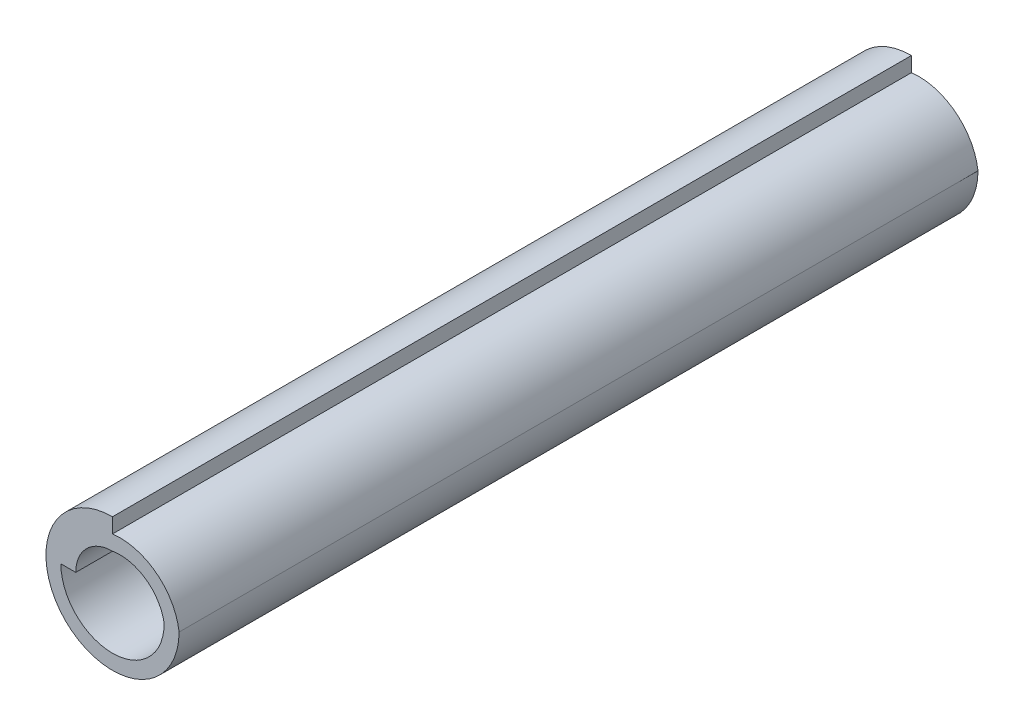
ISO-10303-21;
HEADER;
FILE_DESCRIPTION(('STEP AP214'),'2;1');
FILE_NAME('part.step','',(''),(''),'','','');
FILE_SCHEMA(('AUTOMOTIVE_DESIGN { 1 0 10303 214 1 1 1 1 }'));
ENDSEC;
DATA;
#1=APPLICATION_CONTEXT('core data for automotive mechanical design processes');
#2=APPLICATION_PROTOCOL_DEFINITION('international standard','automotive_design',2000,#1);
#3=PRODUCT_CONTEXT('',#1,'mechanical');
#4=PRODUCT('Part','Part','',(#3));
#5=PRODUCT_RELATED_PRODUCT_CATEGORY('part','',(#4));
#6=PRODUCT_DEFINITION_FORMATION('','',#4);
#7=PRODUCT_DEFINITION_CONTEXT('part definition',#1,'design');
#8=PRODUCT_DEFINITION('design','',#6,#7);
#9=PRODUCT_DEFINITION_SHAPE('','',#8);
#10=(LENGTH_UNIT() NAMED_UNIT(*) SI_UNIT(.MILLI.,.METRE.));
#11=(NAMED_UNIT(*) PLANE_ANGLE_UNIT() SI_UNIT($,.RADIAN.));
#12=(NAMED_UNIT(*) SI_UNIT($,.STERADIAN.) SOLID_ANGLE_UNIT());
#13=UNCERTAINTY_MEASURE_WITH_UNIT(LENGTH_MEASURE(1.E-05),#10,'distance_accuracy_value','');
#14=(GEOMETRIC_REPRESENTATION_CONTEXT(3) GLOBAL_UNCERTAINTY_ASSIGNED_CONTEXT((#13)) GLOBAL_UNIT_ASSIGNED_CONTEXT((#10,
#11,#12)) REPRESENTATION_CONTEXT('',''));
#15=CARTESIAN_POINT('',(0.,0.,0.));
#16=DIRECTION('',(0.,0.,1.));
#17=DIRECTION('',(1.,0.,0.));
#18=AXIS2_PLACEMENT_3D('',#15,#16,#17);
#19=CARTESIAN_POINT('',(0.280000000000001,-0.279999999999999,15.));
#20=DIRECTION('',(0.,0.,1.));
#21=DIRECTION('',(1.,0.,0.));
#22=AXIS2_PLACEMENT_3D('',#19,#20,#21);
#23=PLANE('',#22);
#24=CARTESIAN_POINT('',(0.280000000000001,-0.279999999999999,15.));
#25=DIRECTION('',(0.,0.,1.));
#26=DIRECTION('',(1.,0.,0.));
#27=AXIS2_PLACEMENT_3D('',#24,#25,#26);
#28=CIRCLE('',#27,2.23758798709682);
#29=CARTESIAN_POINT('',(2.5,0.,15.));
#30=VERTEX_POINT('',#29);
#31=CARTESIAN_POINT('',(0.,1.94,15.));
#32=VERTEX_POINT('',#31);
#33=EDGE_CURVE('E128',#30,#32,#28,.T.);
#34=ORIENTED_EDGE('',*,*,#33,.T.);
#35=DIRECTION('',(0.,1.,0.));
#36=VECTOR('',#35,1.);
#37=CARTESIAN_POINT('',(0.,1.94,15.));
#38=LINE('',#37,#36);
#39=CARTESIAN_POINT('',(0.,2.5,15.));
#40=VERTEX_POINT('',#39);
#41=EDGE_CURVE('E131',#32,#40,#38,.T.);
#42=ORIENTED_EDGE('',*,*,#41,.T.);
#43=CARTESIAN_POINT('',(0.,0.,15.));
#44=DIRECTION('',(0.,0.,1.));
#45=DIRECTION('',(1.,0.,0.));
#46=AXIS2_PLACEMENT_3D('',#43,#44,#45);
#47=CIRCLE('',#46,2.5);
#48=EDGE_CURVE('E134',#40,#30,#47,.T.);
#49=ORIENTED_EDGE('',*,*,#48,.T.);
#50=EDGE_LOOP('',(#34,#42,#49));
#51=FACE_BOUND('',#50,.T.);
#52=CARTESIAN_POINT('',(0.280000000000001,-0.279999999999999,15.));
#53=DIRECTION('',(0.,0.,1.));
#54=DIRECTION('',(1.,0.,0.));
#55=AXIS2_PLACEMENT_3D('',#52,#53,#54);
#56=CIRCLE('',#55,1.68344884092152);
#57=CARTESIAN_POINT('',(1.94,0.,15.));
#58=VERTEX_POINT('',#57);
#59=CARTESIAN_POINT('',(0.,1.38,15.));
#60=VERTEX_POINT('',#59);
#61=EDGE_CURVE('E100',#58,#60,#56,.T.);
#62=ORIENTED_EDGE('',*,*,#61,.F.);
#63=CARTESIAN_POINT('',(0.,0.,15.));
#64=DIRECTION('',(0.,0.,1.));
#65=DIRECTION('',(1.,0.,0.));
#66=AXIS2_PLACEMENT_3D('',#63,#64,#65);
#67=CIRCLE('',#66,1.94);
#68=CARTESIAN_POINT('',(-1.94,0.,15.));
#69=VERTEX_POINT('',#68);
#70=EDGE_CURVE('E92',#69,#58,#67,.T.);
#71=ORIENTED_EDGE('',*,*,#70,.F.);
#72=DIRECTION('',(-1.,0.,0.));
#73=VECTOR('',#72,1.);
#74=CARTESIAN_POINT('',(-1.94,0.,15.));
#75=LINE('',#74,#73);
#76=CARTESIAN_POINT('',(-1.38,0.,15.));
#77=VERTEX_POINT('',#76);
#78=EDGE_CURVE('E114',#77,#69,#75,.T.);
#79=ORIENTED_EDGE('',*,*,#78,.F.);
#80=CARTESIAN_POINT('',(0.,0.,15.));
#81=DIRECTION('',(0.,0.,1.));
#82=DIRECTION('',(1.,0.,0.));
#83=AXIS2_PLACEMENT_3D('',#80,#81,#82);
#84=CIRCLE('',#83,1.38);
#85=EDGE_CURVE('E112',#60,#77,#84,.T.);
#86=ORIENTED_EDGE('',*,*,#85,.F.);
#87=EDGE_LOOP('',(#62,#71,#79,#86));
#88=FACE_BOUND('',#87,.T.);
#89=ADVANCED_FACE('F33',(#51,#88),#23,.T.);
#90=CARTESIAN_POINT('',(0.280000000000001,-0.279999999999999,-15.));
#91=DIRECTION('',(0.,0.,1.));
#92=DIRECTION('',(1.,0.,0.));
#93=AXIS2_PLACEMENT_3D('',#90,#91,#92);
#94=PLANE('',#93);
#95=CARTESIAN_POINT('',(0.280000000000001,-0.279999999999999,-15.));
#96=DIRECTION('',(0.,0.,1.));
#97=DIRECTION('',(1.,0.,0.));
#98=AXIS2_PLACEMENT_3D('',#95,#96,#97);
#99=CIRCLE('',#98,2.23758798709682);
#100=CARTESIAN_POINT('',(2.5,0.,-15.));
#101=VERTEX_POINT('',#100);
#102=CARTESIAN_POINT('',(0.,1.94,-15.));
#103=VERTEX_POINT('',#102);
#104=EDGE_CURVE('E108',#101,#103,#99,.T.);
#105=ORIENTED_EDGE('',*,*,#104,.F.);
#106=CARTESIAN_POINT('',(0.,0.,-15.));
#107=DIRECTION('',(0.,0.,1.));
#108=DIRECTION('',(1.,0.,0.));
#109=AXIS2_PLACEMENT_3D('',#106,#107,#108);
#110=CIRCLE('',#109,2.5);
#111=CARTESIAN_POINT('',(0.,2.5,-15.));
#112=VERTEX_POINT('',#111);
#113=EDGE_CURVE('E132',#112,#101,#110,.T.);
#114=ORIENTED_EDGE('',*,*,#113,.F.);
#115=DIRECTION('',(0.,1.,0.));
#116=VECTOR('',#115,1.);
#117=CARTESIAN_POINT('',(0.,1.94,-15.));
#118=LINE('',#117,#116);
#119=EDGE_CURVE('E139',#103,#112,#118,.T.);
#120=ORIENTED_EDGE('',*,*,#119,.F.);
#121=EDGE_LOOP('',(#105,#114,#120));
#122=FACE_BOUND('',#121,.T.);
#123=CARTESIAN_POINT('',(0.,0.,-15.));
#124=DIRECTION('',(0.,0.,1.));
#125=DIRECTION('',(1.,0.,0.));
#126=AXIS2_PLACEMENT_3D('',#123,#124,#125);
#127=CIRCLE('',#126,1.94);
#128=CARTESIAN_POINT('',(-1.94,0.,-15.));
#129=VERTEX_POINT('',#128);
#130=CARTESIAN_POINT('',(1.94,0.,-15.));
#131=VERTEX_POINT('',#130);
#132=EDGE_CURVE('E56',#129,#131,#127,.T.);
#133=ORIENTED_EDGE('',*,*,#132,.T.);
#134=CARTESIAN_POINT('',(0.280000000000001,-0.279999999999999,-15.));
#135=DIRECTION('',(0.,0.,1.));
#136=DIRECTION('',(1.,0.,0.));
#137=AXIS2_PLACEMENT_3D('',#134,#135,#136);
#138=CIRCLE('',#137,1.68344884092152);
#139=CARTESIAN_POINT('',(0.,1.38,-15.));
#140=VERTEX_POINT('',#139);
#141=EDGE_CURVE('E107',#131,#140,#138,.T.);
#142=ORIENTED_EDGE('',*,*,#141,.T.);
#143=CARTESIAN_POINT('',(0.,0.,-15.));
#144=DIRECTION('',(0.,0.,1.));
#145=DIRECTION('',(1.,0.,0.));
#146=AXIS2_PLACEMENT_3D('',#143,#144,#145);
#147=CIRCLE('',#146,1.38);
#148=CARTESIAN_POINT('',(-1.38,0.,-15.));
#149=VERTEX_POINT('',#148);
#150=EDGE_CURVE('E120',#140,#149,#147,.T.);
#151=ORIENTED_EDGE('',*,*,#150,.T.);
#152=DIRECTION('',(-1.,0.,0.));
#153=VECTOR('',#152,1.);
#154=CARTESIAN_POINT('',(-1.94,0.,-15.));
#155=LINE('',#154,#153);
#156=EDGE_CURVE('E101',#149,#129,#155,.T.);
#157=ORIENTED_EDGE('',*,*,#156,.T.);
#158=EDGE_LOOP('',(#133,#142,#151,#157));
#159=FACE_BOUND('',#158,.T.);
#160=ADVANCED_FACE('F153',(#122,#159),#94,.F.);
#161=CARTESIAN_POINT('',(0.280000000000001,-0.279999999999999,15.));
#162=DIRECTION('',(0.,0.,-1.));
#163=DIRECTION('',(-1.,0.,0.));
#164=AXIS2_PLACEMENT_3D('',#161,#162,#163);
#165=CYLINDRICAL_SURFACE('',#164,2.23758798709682);
#166=ORIENTED_EDGE('',*,*,#104,.T.);
#167=DIRECTION('',(0.,0.,-1.));
#168=VECTOR('',#167,1.);
#169=CARTESIAN_POINT('',(0.,1.94,15.));
#170=LINE('',#169,#168);
#171=EDGE_CURVE('E11',#32,#103,#170,.T.);
#172=ORIENTED_EDGE('',*,*,#171,.F.);
#173=ORIENTED_EDGE('',*,*,#33,.F.);
#174=DIRECTION('',(0.,0.,-1.));
#175=VECTOR('',#174,1.);
#176=CARTESIAN_POINT('',(2.5,0.,15.));
#177=LINE('',#176,#175);
#178=EDGE_CURVE('E136',#30,#101,#177,.T.);
#179=ORIENTED_EDGE('',*,*,#178,.T.);
#180=EDGE_LOOP('',(#166,#172,#173,#179));
#181=FACE_BOUND('',#180,.T.);
#182=ADVANCED_FACE('F35',(#181),#165,.T.);
#183=CARTESIAN_POINT('',(0.,1.94,15.));
#184=DIRECTION('',(-1.,0.,0.));
#185=DIRECTION('',(0.,0.,1.));
#186=AXIS2_PLACEMENT_3D('',#183,#184,#185);
#187=PLANE('',#186);
#188=ORIENTED_EDGE('',*,*,#119,.T.);
#189=DIRECTION('',(0.,0.,-1.));
#190=VECTOR('',#189,1.);
#191=CARTESIAN_POINT('',(0.,2.5,15.));
#192=LINE('',#191,#190);
#193=EDGE_CURVE('E41',#40,#112,#192,.T.);
#194=ORIENTED_EDGE('',*,*,#193,.F.);
#195=ORIENTED_EDGE('',*,*,#41,.F.);
#196=ORIENTED_EDGE('',*,*,#171,.T.);
#197=EDGE_LOOP('',(#188,#194,#195,#196));
#198=FACE_BOUND('',#197,.T.);
#199=ADVANCED_FACE('F159',(#198),#187,.F.);
#200=CARTESIAN_POINT('',(0.,0.,15.));
#201=DIRECTION('',(0.,0.,-1.));
#202=DIRECTION('',(-1.,0.,0.));
#203=AXIS2_PLACEMENT_3D('',#200,#201,#202);
#204=CYLINDRICAL_SURFACE('',#203,2.5);
#205=ORIENTED_EDGE('',*,*,#113,.T.);
#206=ORIENTED_EDGE('',*,*,#178,.F.);
#207=ORIENTED_EDGE('',*,*,#48,.F.);
#208=ORIENTED_EDGE('',*,*,#193,.T.);
#209=EDGE_LOOP('',(#205,#206,#207,#208));
#210=FACE_BOUND('',#209,.T.);
#211=ADVANCED_FACE('F148',(#210),#204,.T.);
#212=CARTESIAN_POINT('',(0.,0.,15.));
#213=DIRECTION('',(0.,0.,-1.));
#214=DIRECTION('',(-1.,0.,0.));
#215=AXIS2_PLACEMENT_3D('',#212,#213,#214);
#216=CYLINDRICAL_SURFACE('',#215,1.94);
#217=ORIENTED_EDGE('',*,*,#132,.F.);
#218=DIRECTION('',(0.,0.,-1.));
#219=VECTOR('',#218,1.);
#220=CARTESIAN_POINT('',(-1.94,0.,15.));
#221=LINE('',#220,#219);
#222=EDGE_CURVE('E96',#69,#129,#221,.T.);
#223=ORIENTED_EDGE('',*,*,#222,.F.);
#224=ORIENTED_EDGE('',*,*,#70,.T.);
#225=DIRECTION('',(0.,0.,-1.));
#226=VECTOR('',#225,1.);
#227=CARTESIAN_POINT('',(1.94,0.,15.));
#228=LINE('',#227,#226);
#229=EDGE_CURVE('E95',#58,#131,#228,.T.);
#230=ORIENTED_EDGE('',*,*,#229,.T.);
#231=EDGE_LOOP('',(#217,#223,#224,#230));
#232=FACE_BOUND('',#231,.T.);
#233=ADVANCED_FACE('F94',(#232),#216,.F.);
#234=CARTESIAN_POINT('',(0.280000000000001,-0.279999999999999,15.));
#235=DIRECTION('',(0.,0.,-1.));
#236=DIRECTION('',(-1.,0.,0.));
#237=AXIS2_PLACEMENT_3D('',#234,#235,#236);
#238=CYLINDRICAL_SURFACE('',#237,1.68344884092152);
#239=ORIENTED_EDGE('',*,*,#141,.F.);
#240=ORIENTED_EDGE('',*,*,#229,.F.);
#241=ORIENTED_EDGE('',*,*,#61,.T.);
#242=DIRECTION('',(0.,0.,-1.));
#243=VECTOR('',#242,1.);
#244=CARTESIAN_POINT('',(0.,1.38,15.));
#245=LINE('',#244,#243);
#246=EDGE_CURVE('E109',#60,#140,#245,.T.);
#247=ORIENTED_EDGE('',*,*,#246,.T.);
#248=EDGE_LOOP('',(#239,#240,#241,#247));
#249=FACE_BOUND('',#248,.T.);
#250=ADVANCED_FACE('F104',(#249),#238,.F.);
#251=CARTESIAN_POINT('',(0.,0.,15.));
#252=DIRECTION('',(0.,0.,-1.));
#253=DIRECTION('',(-1.,0.,0.));
#254=AXIS2_PLACEMENT_3D('',#251,#252,#253);
#255=CYLINDRICAL_SURFACE('',#254,1.38);
#256=ORIENTED_EDGE('',*,*,#150,.F.);
#257=ORIENTED_EDGE('',*,*,#246,.F.);
#258=ORIENTED_EDGE('',*,*,#85,.T.);
#259=DIRECTION('',(0.,0.,-1.));
#260=VECTOR('',#259,1.);
#261=CARTESIAN_POINT('',(-1.38,0.,15.));
#262=LINE('',#261,#260);
#263=EDGE_CURVE('E48',#77,#149,#262,.T.);
#264=ORIENTED_EDGE('',*,*,#263,.T.);
#265=EDGE_LOOP('',(#256,#257,#258,#264));
#266=FACE_BOUND('',#265,.T.);
#267=ADVANCED_FACE('F177',(#266),#255,.F.);
#268=CARTESIAN_POINT('',(-1.94,0.,15.));
#269=DIRECTION('',(0.,-1.,0.));
#270=DIRECTION('',(0.,0.,-1.));
#271=AXIS2_PLACEMENT_3D('',#268,#269,#270);
#272=PLANE('',#271);
#273=ORIENTED_EDGE('',*,*,#156,.F.);
#274=ORIENTED_EDGE('',*,*,#263,.F.);
#275=ORIENTED_EDGE('',*,*,#78,.T.);
#276=ORIENTED_EDGE('',*,*,#222,.T.);
#277=EDGE_LOOP('',(#273,#274,#275,#276));
#278=FACE_BOUND('',#277,.T.);
#279=ADVANCED_FACE('F180',(#278),#272,.T.);
#280=CLOSED_SHELL('',(#89,#160,#182,#199,#211,#233,#250,#267,#279));
#281=MANIFOLD_SOLID_BREP('B2',#280);
#282=ADVANCED_BREP_SHAPE_REPRESENTATION('',(#18,#281),#14);
#283=SHAPE_DEFINITION_REPRESENTATION(#9,#282);
ENDSEC;
END-ISO-10303-21;
